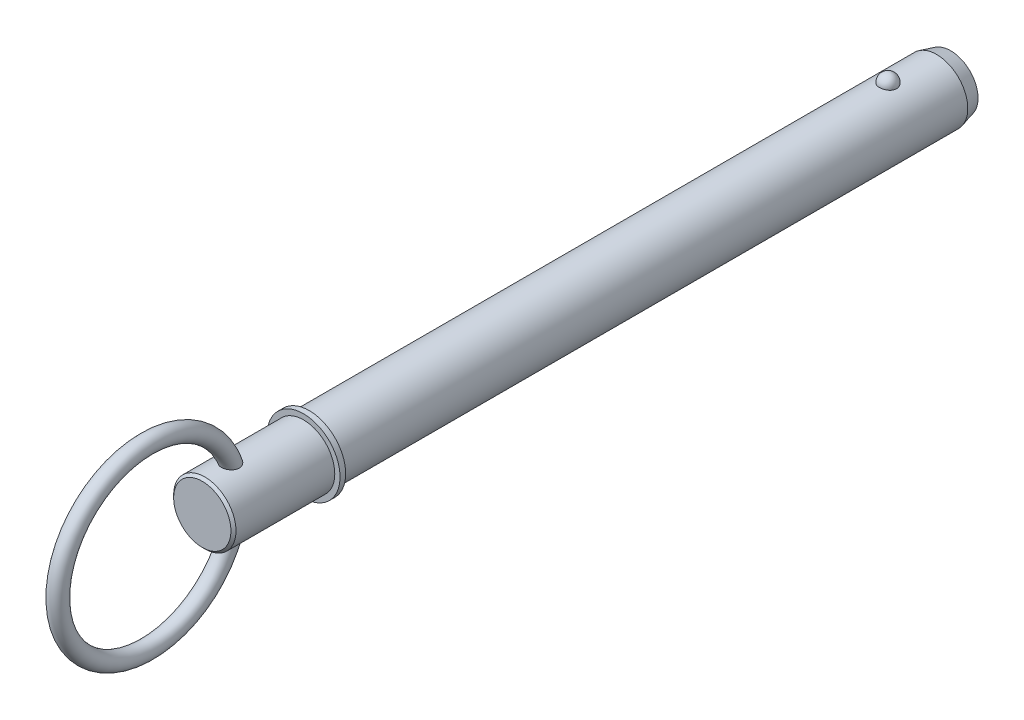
from build123d import *

# Parameters (mm, degrees)
SKETCH2_R           = 11.115
BOSS_EXTRUDE1_DEPTH = 203.2
BOSS_EXTRUDE2_START = 25.4
SKETCH3_R           = 11.115
BOSS_EXTRUDE2_DEPTH = 25.4
CHAMFER1_SIZE       = 5
CHAMFER1_SIZE2      = 1.339745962
SKETCH20_W          = 2
SKETCH20_H          = 13
SKETCH21_R          = 11.115
BOSS_EXTRUDE3_DEPTH = 38.1
CHAMFER2_SIZE       = 0.9
SKETCH24_R          = 3


with BuildPart() as part:
    # Sketch2 → Boss-Extrude1 (new body)
    with BuildSketch(Plane.XY):
        Circle(SKETCH2_R)
    extrude(amount=BOSS_EXTRUDE1_DEPTH)

    # Sketch3 → Boss-Extrude2 (add)
    with BuildSketch(Plane(origin=(0, 0, 0), x_dir=(-1, 0, 0), z_dir=(0, 0, -1)).offset(BOSS_EXTRUDE2_START)):
        Circle(SKETCH3_R)
    extrude(amount=-BOSS_EXTRUDE2_DEPTH)

    # Chamfer1
    chamfer1_edges = [part.edges().sort_by_distance(p)[0] for p in [
        (11.115, 0, -25.4),
    ]]
    chamfer1_side = [part.faces().sort_by_distance(p)[0] for p in [
        (11.115, 0, -12.7),
    ]]
    chamfer(chamfer1_edges, length=CHAMFER1_SIZE, length2=CHAMFER1_SIZE2, reference=chamfer1_side[0])

    # Sketch18 → Revolve1 (revolve)
    with BuildSketch(Plane(origin=(0, 0, 0), x_dir=(0, 0, -1), z_dir=(1, 0, 0))):
        with BuildLine():
            Line((3.07, 14.185), (3.07, 8.045))
            ThreePointArc((3.07, 8.045), (0, 11.115), (3.07, 14.185))
        make_face()
    revolve(axis=Axis((0, 14.185, -3.07), (0, -1, 0)))

    # Sketch20 → Revolve2 (revolve)
    with BuildSketch(Plane(origin=(0, 0, 0), x_dir=(0, 0, -1), z_dir=(1, 0, 0)), mode=Mode.PRIVATE) as revolve2_sk:
        with Locations((-204.2, 6.5)):
            Rectangle(SKETCH20_W, SKETCH20_H)
    revolve(revolve2_sk.sketch.rotate(Axis((0, 0, 33.728787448), (0, 0, 1)), 90), axis=Axis((0, 0, 33.728787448), (0, 0, 1)))

    # Sketch21 → Boss-Extrude3 (add)
    with BuildSketch(Plane(origin=(0, 0, 203.2), x_dir=(-1, 0, 0), z_dir=(0, 0, -1))):
        Circle(SKETCH21_R)
    extrude(amount=-BOSS_EXTRUDE3_DEPTH)

    # Chamfer2
    chamfer2_edges = [part.edges().sort_by_distance(p)[0] for p in [
        (11.115, 0, 241.3),
    ]]
    chamfer(chamfer2_edges, length=CHAMFER2_SIZE)

    # Sweep1: sweep along a path in Sketch23
    with BuildLine(Plane(origin=(0, 0, 0), x_dir=(0, 0, -1), z_dir=(1, 0, 0))) as sweep1_path:
        CenterArc((-261.05, 0), 31.75, 0, 360)
    # Sketch24 → Sweep1 (sweep)
    with BuildSketch(Plane(origin=(0, 0, 0), x_dir=(1, 0, 0), z_dir=(0, 1, 0))):
        with Locations((0, -229.3)):
            Circle(SKETCH24_R)
    sweep(path=sweep1_path.line)


solid = part.part
